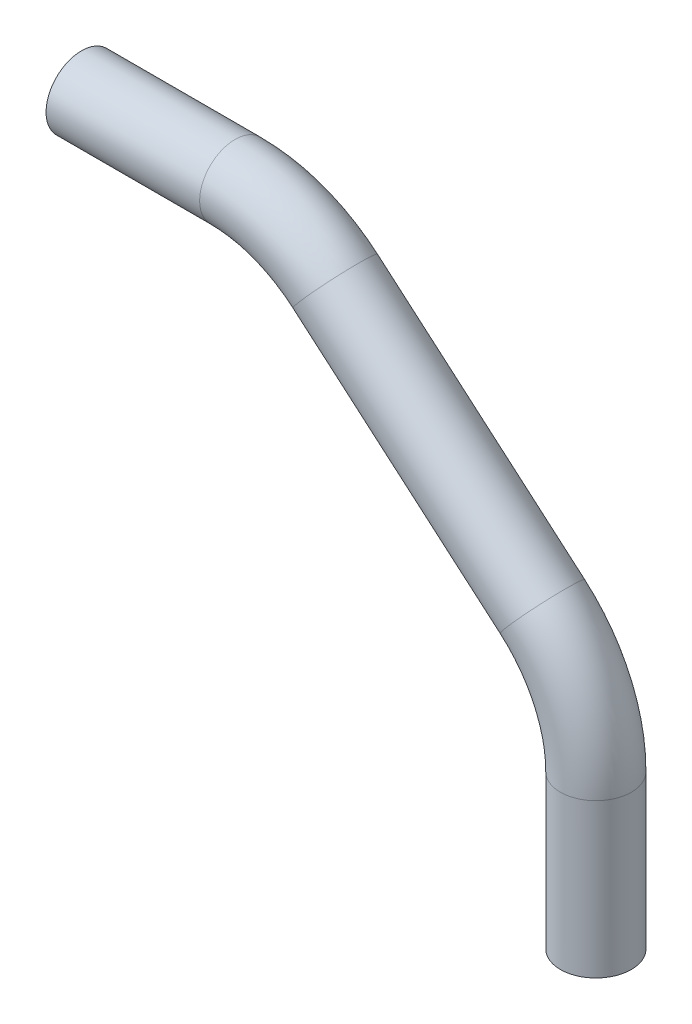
ISO-10303-21;
HEADER;
FILE_DESCRIPTION(('STEP AP214'),'2;1');
FILE_NAME('part.step','',(''),(''),'','','');
FILE_SCHEMA(('AUTOMOTIVE_DESIGN { 1 0 10303 214 1 1 1 1 }'));
ENDSEC;
DATA;
#1=APPLICATION_CONTEXT('core data for automotive mechanical design processes');
#2=APPLICATION_PROTOCOL_DEFINITION('international standard','automotive_design',2000,#1);
#3=PRODUCT_CONTEXT('',#1,'mechanical');
#4=PRODUCT('Part','Part','',(#3));
#5=PRODUCT_RELATED_PRODUCT_CATEGORY('part','',(#4));
#6=PRODUCT_DEFINITION_FORMATION('','',#4);
#7=PRODUCT_DEFINITION_CONTEXT('part definition',#1,'design');
#8=PRODUCT_DEFINITION('design','',#6,#7);
#9=PRODUCT_DEFINITION_SHAPE('','',#8);
#10=(LENGTH_UNIT() NAMED_UNIT(*) SI_UNIT(.MILLI.,.METRE.));
#11=(NAMED_UNIT(*) PLANE_ANGLE_UNIT() SI_UNIT($,.RADIAN.));
#12=(NAMED_UNIT(*) SI_UNIT($,.STERADIAN.) SOLID_ANGLE_UNIT());
#13=UNCERTAINTY_MEASURE_WITH_UNIT(LENGTH_MEASURE(1.E-05),#10,'distance_accuracy_value','');
#14=(GEOMETRIC_REPRESENTATION_CONTEXT(3) GLOBAL_UNCERTAINTY_ASSIGNED_CONTEXT((#13)) GLOBAL_UNIT_ASSIGNED_CONTEXT((#10,
#11,#12)) REPRESENTATION_CONTEXT('',''));
#15=CARTESIAN_POINT('',(0.,0.,0.));
#16=DIRECTION('',(0.,0.,1.));
#17=DIRECTION('',(1.,0.,0.));
#18=AXIS2_PLACEMENT_3D('',#15,#16,#17);
#19=CARTESIAN_POINT('',(-48.4865206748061,65.2261656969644,0.));
#20=DIRECTION('',(-1.,0.,0.));
#21=DIRECTION('',(0.,0.,1.));
#22=AXIS2_PLACEMENT_3D('',#19,#20,#21);
#23=CYLINDRICAL_SURFACE('',#22,4.7625);
#24=CARTESIAN_POINT('',(-48.4865206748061,65.2261656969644,0.));
#25=DIRECTION('',(-1.,0.,0.));
#26=DIRECTION('',(0.,0.,1.));
#27=AXIS2_PLACEMENT_3D('',#24,#25,#26);
#28=CIRCLE('',#27,4.7625);
#29=CARTESIAN_POINT('',(-48.4865206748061,69.9886656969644,0.));
#30=VERTEX_POINT('',#29);
#31=EDGE_CURVE('E43',#30,#30,#28,.T.);
#32=ORIENTED_EDGE('',*,*,#31,.T.);
#33=EDGE_LOOP('',(#32));
#34=FACE_BOUND('',#33,.T.);
#35=CARTESIAN_POINT('',(-69.1240206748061,65.2261656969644,0.));
#36=DIRECTION('',(-1.,0.,0.));
#37=DIRECTION('',(0.,0.,1.));
#38=AXIS2_PLACEMENT_3D('',#35,#36,#37);
#39=CIRCLE('',#38,4.7625);
#40=CARTESIAN_POINT('',(-69.1240206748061,65.2261656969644,4.7625));
#41=VERTEX_POINT('',#40);
#42=EDGE_CURVE('E10',#41,#41,#39,.T.);
#43=ORIENTED_EDGE('',*,*,#42,.F.);
#44=EDGE_LOOP('',(#43));
#45=FACE_BOUND('',#44,.T.);
#46=ADVANCED_FACE('F33',(#34,#45),#23,.T.);
#47=CARTESIAN_POINT('',(-48.4865206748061,65.2261656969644,0.));
#48=DIRECTION('',(-1.,0.,0.));
#49=DIRECTION('',(0.,0.,1.));
#50=AXIS2_PLACEMENT_3D('',#47,#48,#49);
#51=CYLINDRICAL_SURFACE('',#50,3.8735);
#52=CARTESIAN_POINT('',(-48.4865206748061,65.2261656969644,0.));
#53=DIRECTION('',(-1.,0.,0.));
#54=DIRECTION('',(0.,0.,1.));
#55=AXIS2_PLACEMENT_3D('',#52,#53,#54);
#56=CIRCLE('',#55,3.8735);
#57=CARTESIAN_POINT('',(-48.4865206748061,69.0996656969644,0.));
#58=VERTEX_POINT('',#57);
#59=EDGE_CURVE('E47',#58,#58,#56,.T.);
#60=ORIENTED_EDGE('',*,*,#59,.F.);
#61=EDGE_LOOP('',(#60));
#62=FACE_BOUND('',#61,.T.);
#63=CARTESIAN_POINT('',(-69.1240206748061,65.2261656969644,0.));
#64=DIRECTION('',(-1.,0.,0.));
#65=DIRECTION('',(0.,0.,1.));
#66=AXIS2_PLACEMENT_3D('',#63,#64,#65);
#67=CIRCLE('',#66,3.8735);
#68=CARTESIAN_POINT('',(-69.1240206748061,65.2261656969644,3.8735));
#69=VERTEX_POINT('',#68);
#70=EDGE_CURVE('E39',#69,#69,#67,.T.);
#71=ORIENTED_EDGE('',*,*,#70,.T.);
#72=EDGE_LOOP('',(#71));
#73=FACE_BOUND('',#72,.T.);
#74=ADVANCED_FACE('F101',(#62,#73),#51,.F.);
#75=CARTESIAN_POINT('',(-48.4865206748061,44.5886656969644,0.));
#76=DIRECTION('',(0.,0.,1.));
#77=DIRECTION('',(1.,0.,0.));
#78=AXIS2_PLACEMENT_3D('',#75,#76,#77);
#79=TOROIDAL_SURFACE('',#78,20.6375,4.7625);
#80=CARTESIAN_POINT('',(-35.0297347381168,60.2354327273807,0.));
#81=DIRECTION('',(-0.758171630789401,0.652055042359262,0.));
#82=DIRECTION('',(0.,0.,1.));
#83=AXIS2_PLACEMENT_3D('',#80,#81,#82);
#84=CIRCLE('',#83,4.7625);
#85=CARTESIAN_POINT('',(-31.9243225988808,63.8462251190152,0.));
#86=VERTEX_POINT('',#85);
#87=EDGE_CURVE('E52',#86,#86,#84,.T.);
#88=CARTESIAN_POINT('',(-48.4865206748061,44.5886656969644,0.));
#89=DIRECTION('',(0.,0.,1.));
#90=DIRECTION('',(1.,0.,0.));
#91=AXIS2_PLACEMENT_3D('',#88,#89,#90);
#92=CIRCLE('',#91,25.4);
#93=EDGE_CURVE('',#86,#30,#92,.T.);
#94=ORIENTED_EDGE('',*,*,#87,.T.);
#95=ORIENTED_EDGE('',*,*,#31,.F.);
#96=ORIENTED_EDGE('',*,*,#93,.T.);
#97=ORIENTED_EDGE('',*,*,#93,.F.);
#98=EDGE_LOOP('',(#94,#96,#95,#97));
#99=FACE_BOUND('',#98,.T.);
#100=ADVANCED_FACE('F97',(#99),#79,.T.);
#101=CARTESIAN_POINT('',(-48.4865206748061,44.5886656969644,0.));
#102=DIRECTION('',(0.,0.,1.));
#103=DIRECTION('',(1.,0.,0.));
#104=AXIS2_PLACEMENT_3D('',#101,#102,#103);
#105=TOROIDAL_SURFACE('',#104,20.6375,3.8735);
#106=CARTESIAN_POINT('',(-35.0297347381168,60.2354327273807,0.));
#107=DIRECTION('',(-0.758171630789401,0.652055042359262,0.));
#108=DIRECTION('',(0.,0.,1.));
#109=AXIS2_PLACEMENT_3D('',#106,#107,#108);
#110=CIRCLE('',#109,3.8735);
#111=CARTESIAN_POINT('',(-32.5039995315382,63.1722105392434,0.));
#112=VERTEX_POINT('',#111);
#113=EDGE_CURVE('E55',#112,#112,#110,.T.);
#114=CARTESIAN_POINT('',(-48.4865206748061,44.5886656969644,0.));
#115=DIRECTION('',(0.,0.,1.));
#116=DIRECTION('',(1.,0.,0.));
#117=AXIS2_PLACEMENT_3D('',#114,#115,#116);
#118=CIRCLE('',#117,24.511);
#119=EDGE_CURVE('',#112,#58,#118,.T.);
#120=ORIENTED_EDGE('',*,*,#113,.F.);
#121=ORIENTED_EDGE('',*,*,#59,.T.);
#122=ORIENTED_EDGE('',*,*,#119,.T.);
#123=ORIENTED_EDGE('',*,*,#119,.F.);
#124=EDGE_LOOP('',(#120,#122,#121,#123));
#125=FACE_BOUND('',#124,.T.);
#126=ADVANCED_FACE('F94',(#125),#105,.F.);
#127=CARTESIAN_POINT('',(-7.18071406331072,36.2842670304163,0.));
#128=DIRECTION('',(-0.758171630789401,0.652055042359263,0.));
#129=DIRECTION('',(-0.652055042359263,-0.758171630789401,0.));
#130=AXIS2_PLACEMENT_3D('',#127,#128,#129);
#131=CYLINDRICAL_SURFACE('',#130,4.7625);
#132=CARTESIAN_POINT('',(-7.18071406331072,36.2842670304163,0.));
#133=DIRECTION('',(-0.758171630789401,0.652055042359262,0.));
#134=DIRECTION('',(0.,0.,1.));
#135=AXIS2_PLACEMENT_3D('',#132,#133,#134);
#136=CIRCLE('',#135,4.7625);
#137=CARTESIAN_POINT('',(-4.07530192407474,39.8950594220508,0.));
#138=VERTEX_POINT('',#137);
#139=EDGE_CURVE('E58',#138,#138,#136,.T.);
#140=ORIENTED_EDGE('',*,*,#139,.T.);
#141=EDGE_LOOP('',(#140));
#142=FACE_BOUND('',#141,.T.);
#143=ORIENTED_EDGE('',*,*,#87,.F.);
#144=EDGE_LOOP('',(#143));
#145=FACE_BOUND('',#144,.T.);
#146=ADVANCED_FACE('F90',(#142,#145),#131,.T.);
#147=CARTESIAN_POINT('',(-7.18071406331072,36.2842670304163,0.));
#148=DIRECTION('',(-0.758171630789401,0.652055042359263,0.));
#149=DIRECTION('',(-0.652055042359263,-0.758171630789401,0.));
#150=AXIS2_PLACEMENT_3D('',#147,#148,#149);
#151=CYLINDRICAL_SURFACE('',#150,3.8735);
#152=CARTESIAN_POINT('',(-7.18071406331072,36.2842670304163,0.));
#153=DIRECTION('',(-0.758171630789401,0.652055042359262,0.));
#154=DIRECTION('',(0.,0.,1.));
#155=AXIS2_PLACEMENT_3D('',#152,#153,#154);
#156=CIRCLE('',#155,3.8735);
#157=CARTESIAN_POINT('',(-4.65497885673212,39.221044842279,0.));
#158=VERTEX_POINT('',#157);
#159=EDGE_CURVE('E61',#158,#158,#156,.T.);
#160=ORIENTED_EDGE('',*,*,#159,.F.);
#161=EDGE_LOOP('',(#160));
#162=FACE_BOUND('',#161,.T.);
#163=ORIENTED_EDGE('',*,*,#113,.T.);
#164=EDGE_LOOP('',(#163));
#165=FACE_BOUND('',#164,.T.);
#166=ADVANCED_FACE('F87',(#162,#165),#151,.F.);
#167=CARTESIAN_POINT('',(-20.6375,20.6375,0.));
#168=DIRECTION('',(0.,0.,1.));
#169=DIRECTION('',(1.,0.,0.));
#170=AXIS2_PLACEMENT_3D('',#167,#168,#169);
#171=TOROIDAL_SURFACE('',#170,20.6375,4.7625);
#172=CARTESIAN_POINT('',(0.,20.6375,0.));
#173=DIRECTION('',(0.,1.,0.));
#174=DIRECTION('',(0.,0.,1.));
#175=AXIS2_PLACEMENT_3D('',#172,#173,#174);
#176=CIRCLE('',#175,4.7625);
#177=CARTESIAN_POINT('',(4.7625,20.6375,0.));
#178=VERTEX_POINT('',#177);
#179=EDGE_CURVE('E64',#178,#178,#176,.T.);
#180=CARTESIAN_POINT('',(-20.6375,20.6375,0.));
#181=DIRECTION('',(0.,0.,1.));
#182=DIRECTION('',(1.,0.,0.));
#183=AXIS2_PLACEMENT_3D('',#180,#181,#182);
#184=CIRCLE('',#183,25.4);
#185=EDGE_CURVE('',#178,#138,#184,.T.);
#186=ORIENTED_EDGE('',*,*,#179,.T.);
#187=ORIENTED_EDGE('',*,*,#139,.F.);
#188=ORIENTED_EDGE('',*,*,#185,.T.);
#189=ORIENTED_EDGE('',*,*,#185,.F.);
#190=EDGE_LOOP('',(#186,#188,#187,#189));
#191=FACE_BOUND('',#190,.T.);
#192=ADVANCED_FACE('F83',(#191),#171,.T.);
#193=CARTESIAN_POINT('',(-20.6375,20.6375,0.));
#194=DIRECTION('',(0.,0.,1.));
#195=DIRECTION('',(1.,0.,0.));
#196=AXIS2_PLACEMENT_3D('',#193,#194,#195);
#197=TOROIDAL_SURFACE('',#196,20.6375,3.8735);
#198=CARTESIAN_POINT('',(0.,20.6375,0.));
#199=DIRECTION('',(0.,1.,0.));
#200=DIRECTION('',(0.,0.,1.));
#201=AXIS2_PLACEMENT_3D('',#198,#199,#200);
#202=CIRCLE('',#201,3.8735);
#203=CARTESIAN_POINT('',(3.8735,20.6375,0.));
#204=VERTEX_POINT('',#203);
#205=EDGE_CURVE('E68',#204,#204,#202,.T.);
#206=CARTESIAN_POINT('',(-20.6375,20.6375,0.));
#207=DIRECTION('',(0.,0.,1.));
#208=DIRECTION('',(1.,0.,0.));
#209=AXIS2_PLACEMENT_3D('',#206,#207,#208);
#210=CIRCLE('',#209,24.511);
#211=EDGE_CURVE('',#204,#158,#210,.T.);
#212=ORIENTED_EDGE('',*,*,#205,.F.);
#213=ORIENTED_EDGE('',*,*,#159,.T.);
#214=ORIENTED_EDGE('',*,*,#211,.T.);
#215=ORIENTED_EDGE('',*,*,#211,.F.);
#216=EDGE_LOOP('',(#212,#214,#213,#215));
#217=FACE_BOUND('',#216,.T.);
#218=ADVANCED_FACE('F80',(#217),#197,.F.);
#219=CARTESIAN_POINT('',(0.,20.6375,0.));
#220=DIRECTION('',(0.,-1.,0.));
#221=DIRECTION('',(0.,0.,-1.));
#222=AXIS2_PLACEMENT_3D('',#219,#220,#221);
#223=CYLINDRICAL_SURFACE('',#222,3.8735);
#224=ORIENTED_EDGE('',*,*,#205,.T.);
#225=EDGE_LOOP('',(#224));
#226=FACE_BOUND('',#225,.T.);
#227=CARTESIAN_POINT('',(0.,0.,0.));
#228=DIRECTION('',(0.,1.,0.));
#229=DIRECTION('',(0.,0.,1.));
#230=AXIS2_PLACEMENT_3D('',#227,#228,#229);
#231=CIRCLE('',#230,3.8735);
#232=CARTESIAN_POINT('',(0.,0.,3.8735));
#233=VERTEX_POINT('',#232);
#234=EDGE_CURVE('E69',#233,#233,#231,.T.);
#235=ORIENTED_EDGE('',*,*,#234,.F.);
#236=EDGE_LOOP('',(#235));
#237=FACE_BOUND('',#236,.T.);
#238=ADVANCED_FACE('F77',(#226,#237),#223,.F.);
#239=CARTESIAN_POINT('',(0.,20.6375,0.));
#240=DIRECTION('',(0.,-1.,0.));
#241=DIRECTION('',(0.,0.,-1.));
#242=AXIS2_PLACEMENT_3D('',#239,#240,#241);
#243=CYLINDRICAL_SURFACE('',#242,4.7625);
#244=ORIENTED_EDGE('',*,*,#179,.F.);
#245=EDGE_LOOP('',(#244));
#246=FACE_BOUND('',#245,.T.);
#247=CARTESIAN_POINT('',(0.,0.,0.));
#248=DIRECTION('',(0.,1.,0.));
#249=DIRECTION('',(0.,0.,1.));
#250=AXIS2_PLACEMENT_3D('',#247,#248,#249);
#251=CIRCLE('',#250,4.7625);
#252=CARTESIAN_POINT('',(0.,0.,4.7625));
#253=VERTEX_POINT('',#252);
#254=EDGE_CURVE('E65',#253,#253,#251,.T.);
#255=ORIENTED_EDGE('',*,*,#254,.T.);
#256=EDGE_LOOP('',(#255));
#257=FACE_BOUND('',#256,.T.);
#258=ADVANCED_FACE('F119',(#246,#257),#243,.T.);
#259=CARTESIAN_POINT('',(-69.1240206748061,65.2261656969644,0.));
#260=DIRECTION('',(-1.,0.,0.));
#261=DIRECTION('',(0.,0.,1.));
#262=AXIS2_PLACEMENT_3D('',#259,#260,#261);
#263=PLANE('',#262);
#264=ORIENTED_EDGE('',*,*,#70,.F.);
#265=EDGE_LOOP('',(#264));
#266=FACE_BOUND('',#265,.T.);
#267=ORIENTED_EDGE('',*,*,#42,.T.);
#268=EDGE_LOOP('',(#267));
#269=FACE_BOUND('',#268,.T.);
#270=ADVANCED_FACE('F122',(#266,#269),#263,.T.);
#271=CARTESIAN_POINT('',(0.,0.,0.));
#272=DIRECTION('',(0.,1.,0.));
#273=DIRECTION('',(0.,0.,1.));
#274=AXIS2_PLACEMENT_3D('',#271,#272,#273);
#275=PLANE('',#274);
#276=ORIENTED_EDGE('',*,*,#234,.T.);
#277=EDGE_LOOP('',(#276));
#278=FACE_BOUND('',#277,.T.);
#279=ORIENTED_EDGE('',*,*,#254,.F.);
#280=EDGE_LOOP('',(#279));
#281=FACE_BOUND('',#280,.T.);
#282=ADVANCED_FACE('F124',(#278,#281),#275,.F.);
#283=CLOSED_SHELL('',(#46,#74,#100,#126,#146,#166,#192,#218,#238,#258,#270,#282));
#284=MANIFOLD_SOLID_BREP('B2',#283);
#285=ADVANCED_BREP_SHAPE_REPRESENTATION('',(#18,#284),#14);
#286=SHAPE_DEFINITION_REPRESENTATION(#9,#285);
ENDSEC;
END-ISO-10303-21;
